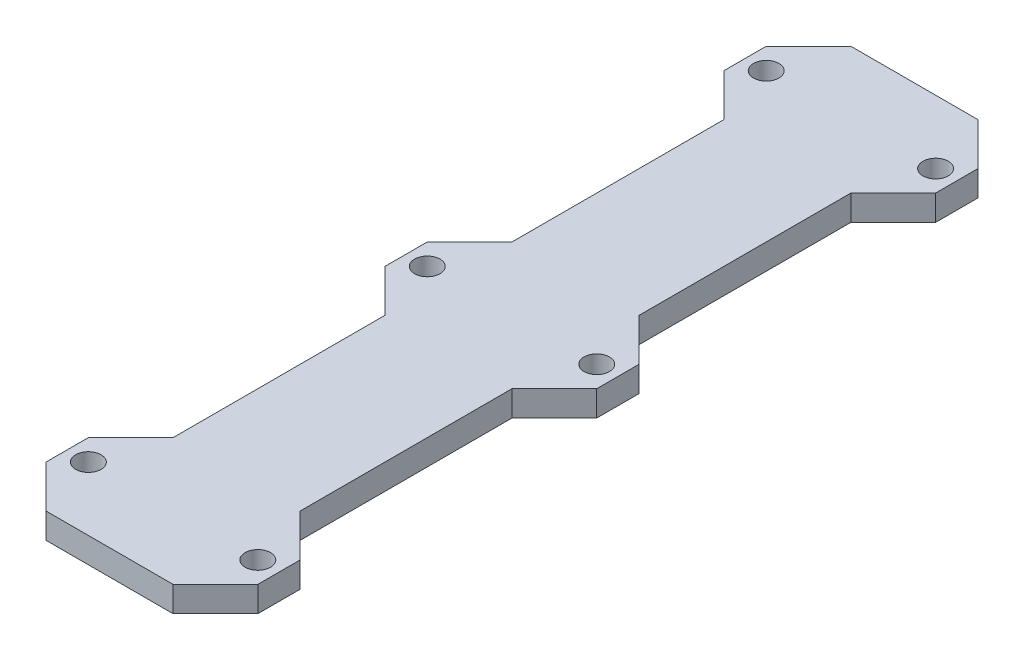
ISO-10303-21;
HEADER;
FILE_DESCRIPTION(('STEP AP214'),'2;1');
FILE_NAME('part.step','',(''),(''),'','','');
FILE_SCHEMA(('AUTOMOTIVE_DESIGN { 1 0 10303 214 1 1 1 1 }'));
ENDSEC;
DATA;
#1=APPLICATION_CONTEXT('core data for automotive mechanical design processes');
#2=APPLICATION_PROTOCOL_DEFINITION('international standard','automotive_design',2000,#1);
#3=PRODUCT_CONTEXT('',#1,'mechanical');
#4=PRODUCT('Part','Part','',(#3));
#5=PRODUCT_RELATED_PRODUCT_CATEGORY('part','',(#4));
#6=PRODUCT_DEFINITION_FORMATION('','',#4);
#7=PRODUCT_DEFINITION_CONTEXT('part definition',#1,'design');
#8=PRODUCT_DEFINITION('design','',#6,#7);
#9=PRODUCT_DEFINITION_SHAPE('','',#8);
#10=(LENGTH_UNIT() NAMED_UNIT(*) SI_UNIT(.MILLI.,.METRE.));
#11=(NAMED_UNIT(*) PLANE_ANGLE_UNIT() SI_UNIT($,.RADIAN.));
#12=(NAMED_UNIT(*) SI_UNIT($,.STERADIAN.) SOLID_ANGLE_UNIT());
#13=UNCERTAINTY_MEASURE_WITH_UNIT(LENGTH_MEASURE(1.E-05),#10,'distance_accuracy_value','');
#14=(GEOMETRIC_REPRESENTATION_CONTEXT(3) GLOBAL_UNCERTAINTY_ASSIGNED_CONTEXT((#13)) GLOBAL_UNIT_ASSIGNED_CONTEXT((#10,
#11,#12)) REPRESENTATION_CONTEXT('',''));
#15=CARTESIAN_POINT('',(0.,0.,0.));
#16=DIRECTION('',(0.,0.,1.));
#17=DIRECTION('',(1.,0.,0.));
#18=AXIS2_PLACEMENT_3D('',#15,#16,#17);
#19=CARTESIAN_POINT('',(0.,3.,0.));
#20=DIRECTION('',(0.,1.,0.));
#21=DIRECTION('',(0.,0.,1.));
#22=AXIS2_PLACEMENT_3D('',#19,#20,#21);
#23=PLANE('',#22);
#24=CARTESIAN_POINT('',(-10.,3.,-40.));
#25=DIRECTION('',(0.,1.,0.));
#26=DIRECTION('',(0.,0.,-1.));
#27=AXIS2_PLACEMENT_3D('',#24,#25,#26);
#28=CIRCLE('',#27,1.5);
#29=CARTESIAN_POINT('',(-10.,3.,-41.5));
#30=VERTEX_POINT('',#29);
#31=EDGE_CURVE('E458',#30,#30,#28,.T.);
#32=ORIENTED_EDGE('',*,*,#31,.F.);
#33=EDGE_LOOP('',(#32));
#34=FACE_BOUND('',#33,.T.);
#35=CARTESIAN_POINT('',(9.99999999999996,3.,40.));
#36=DIRECTION('',(0.,1.,0.));
#37=DIRECTION('',(0.,0.,1.));
#38=AXIS2_PLACEMENT_3D('',#35,#36,#37);
#39=CIRCLE('',#38,1.5);
#40=CARTESIAN_POINT('',(9.99999999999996,3.,41.5));
#41=VERTEX_POINT('',#40);
#42=EDGE_CURVE('E470',#41,#41,#39,.T.);
#43=ORIENTED_EDGE('',*,*,#42,.F.);
#44=EDGE_LOOP('',(#43));
#45=FACE_BOUND('',#44,.T.);
#46=CARTESIAN_POINT('',(10.,3.,-40.));
#47=DIRECTION('',(0.,1.,0.));
#48=DIRECTION('',(0.,0.,1.));
#49=AXIS2_PLACEMENT_3D('',#46,#47,#48);
#50=CIRCLE('',#49,1.5);
#51=CARTESIAN_POINT('',(10.,3.,-38.5));
#52=VERTEX_POINT('',#51);
#53=EDGE_CURVE('E233',#52,#52,#50,.T.);
#54=ORIENTED_EDGE('',*,*,#53,.F.);
#55=EDGE_LOOP('',(#54));
#56=FACE_BOUND('',#55,.T.);
#57=DIRECTION('',(0.707106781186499,0.,0.707106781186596));
#58=VECTOR('',#57,1.);
#59=CARTESIAN_POINT('',(-12.5,3.,2.50000000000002));
#60=LINE('',#59,#58);
#61=CARTESIAN_POINT('',(-12.5,3.,2.50000000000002));
#62=VERTEX_POINT('',#61);
#63=CARTESIAN_POINT('',(-7.5,3.,7.50000000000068));
#64=VERTEX_POINT('',#63);
#65=EDGE_CURVE('E276',#62,#64,#60,.T.);
#66=ORIENTED_EDGE('',*,*,#65,.T.);
#67=DIRECTION('',(0.,0.,1.));
#68=VECTOR('',#67,1.);
#69=CARTESIAN_POINT('',(-7.5,3.,7.50000000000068));
#70=LINE('',#69,#68);
#71=CARTESIAN_POINT('',(-7.49999999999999,3.,32.5000000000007));
#72=VERTEX_POINT('',#71);
#73=EDGE_CURVE('E144',#64,#72,#70,.T.);
#74=ORIENTED_EDGE('',*,*,#73,.T.);
#75=DIRECTION('',(-0.707106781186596,0.,0.707106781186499));
#76=VECTOR('',#75,1.);
#77=CARTESIAN_POINT('',(-12.5,3.,37.5));
#78=LINE('',#77,#76);
#79=CARTESIAN_POINT('',(-12.5,3.,37.5));
#80=VERTEX_POINT('',#79);
#81=EDGE_CURVE('E339',#72,#80,#78,.T.);
#82=ORIENTED_EDGE('',*,*,#81,.T.);
#83=DIRECTION('',(0.,0.,1.));
#84=VECTOR('',#83,1.);
#85=CARTESIAN_POINT('',(-12.5,3.,42.5));
#86=LINE('',#85,#84);
#87=CARTESIAN_POINT('',(-12.5,3.,42.5));
#88=VERTEX_POINT('',#87);
#89=EDGE_CURVE('E358',#80,#88,#86,.T.);
#90=ORIENTED_EDGE('',*,*,#89,.T.);
#91=DIRECTION('',(0.707106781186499,0.,0.707106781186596));
#92=VECTOR('',#91,1.);
#93=CARTESIAN_POINT('',(-12.5,3.,42.5));
#94=LINE('',#93,#92);
#95=CARTESIAN_POINT('',(-7.5,3.,47.5000000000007));
#96=VERTEX_POINT('',#95);
#97=EDGE_CURVE('E355',#88,#96,#94,.T.);
#98=ORIENTED_EDGE('',*,*,#97,.T.);
#99=DIRECTION('',(1.,0.,0.));
#100=VECTOR('',#99,1.);
#101=CARTESIAN_POINT('',(-7.5,3.,47.5000000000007));
#102=LINE('',#101,#100);
#103=CARTESIAN_POINT('',(7.5,3.,47.5000000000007));
#104=VERTEX_POINT('',#103);
#105=EDGE_CURVE('E357',#96,#104,#102,.T.);
#106=ORIENTED_EDGE('',*,*,#105,.T.);
#107=DIRECTION('',(0.707106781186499,0.,-0.707106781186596));
#108=VECTOR('',#107,1.);
#109=CARTESIAN_POINT('',(12.5,3.,42.5));
#110=LINE('',#109,#108);
#111=CARTESIAN_POINT('',(12.5,3.,42.5));
#112=VERTEX_POINT('',#111);
#113=EDGE_CURVE('E360',#104,#112,#110,.T.);
#114=ORIENTED_EDGE('',*,*,#113,.T.);
#115=DIRECTION('',(0.,0.,-1.));
#116=VECTOR('',#115,1.);
#117=CARTESIAN_POINT('',(12.5,3.,42.5));
#118=LINE('',#117,#116);
#119=CARTESIAN_POINT('',(12.5,3.,37.5));
#120=VERTEX_POINT('',#119);
#121=EDGE_CURVE('E366',#112,#120,#118,.T.);
#122=ORIENTED_EDGE('',*,*,#121,.T.);
#123=DIRECTION('',(-0.707106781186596,0.,-0.707106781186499));
#124=VECTOR('',#123,1.);
#125=CARTESIAN_POINT('',(12.5,3.,37.5));
#126=LINE('',#125,#124);
#127=CARTESIAN_POINT('',(7.49999999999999,3.,32.5000000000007));
#128=VERTEX_POINT('',#127);
#129=EDGE_CURVE('E368',#120,#128,#126,.T.);
#130=ORIENTED_EDGE('',*,*,#129,.T.);
#131=DIRECTION('',(0.,0.,-1.));
#132=VECTOR('',#131,1.);
#133=CARTESIAN_POINT('',(7.49999999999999,3.,32.5000000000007));
#134=LINE('',#133,#132);
#135=CARTESIAN_POINT('',(7.5,3.,7.50000000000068));
#136=VERTEX_POINT('',#135);
#137=EDGE_CURVE('E370',#128,#136,#134,.T.);
#138=ORIENTED_EDGE('',*,*,#137,.T.);
#139=DIRECTION('',(0.707106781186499,0.,-0.707106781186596));
#140=VECTOR('',#139,1.);
#141=CARTESIAN_POINT('',(12.5,3.,2.50000000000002));
#142=LINE('',#141,#140);
#143=CARTESIAN_POINT('',(12.5,3.,2.50000000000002));
#144=VERTEX_POINT('',#143);
#145=EDGE_CURVE('E372',#136,#144,#142,.T.);
#146=ORIENTED_EDGE('',*,*,#145,.T.);
#147=DIRECTION('',(0.,0.,-1.));
#148=VECTOR('',#147,1.);
#149=CARTESIAN_POINT('',(12.5,3.,2.50000000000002));
#150=LINE('',#149,#148);
#151=CARTESIAN_POINT('',(12.5,3.,-2.50000000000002));
#152=VERTEX_POINT('',#151);
#153=EDGE_CURVE('E374',#144,#152,#150,.T.);
#154=ORIENTED_EDGE('',*,*,#153,.T.);
#155=DIRECTION('',(-0.707106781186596,0.,-0.707106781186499));
#156=VECTOR('',#155,1.);
#157=CARTESIAN_POINT('',(12.5,3.,-2.50000000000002));
#158=LINE('',#157,#156);
#159=CARTESIAN_POINT('',(7.5,3.,-7.49999999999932));
#160=VERTEX_POINT('',#159);
#161=EDGE_CURVE('E376',#152,#160,#158,.T.);
#162=ORIENTED_EDGE('',*,*,#161,.T.);
#163=DIRECTION('',(0.,0.,-1.));
#164=VECTOR('',#163,1.);
#165=CARTESIAN_POINT('',(7.5,3.,-7.49999999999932));
#166=LINE('',#165,#164);
#167=CARTESIAN_POINT('',(7.50000000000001,3.,-32.4999999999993));
#168=VERTEX_POINT('',#167);
#169=EDGE_CURVE('E378',#160,#168,#166,.T.);
#170=ORIENTED_EDGE('',*,*,#169,.T.);
#171=DIRECTION('',(0.707106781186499,0.,-0.707106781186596));
#172=VECTOR('',#171,1.);
#173=CARTESIAN_POINT('',(12.5,3.,-37.5));
#174=LINE('',#173,#172);
#175=CARTESIAN_POINT('',(12.5,3.,-37.5));
#176=VERTEX_POINT('',#175);
#177=EDGE_CURVE('E380',#168,#176,#174,.T.);
#178=ORIENTED_EDGE('',*,*,#177,.T.);
#179=DIRECTION('',(0.,0.,-1.));
#180=VECTOR('',#179,1.);
#181=CARTESIAN_POINT('',(12.5,3.,-37.5));
#182=LINE('',#181,#180);
#183=CARTESIAN_POINT('',(12.5,3.,-42.5));
#184=VERTEX_POINT('',#183);
#185=EDGE_CURVE('E382',#176,#184,#182,.T.);
#186=ORIENTED_EDGE('',*,*,#185,.T.);
#187=DIRECTION('',(-0.707106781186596,0.,-0.7071067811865));
#188=VECTOR('',#187,1.);
#189=CARTESIAN_POINT('',(12.5,3.,-42.5));
#190=LINE('',#189,#188);
#191=CARTESIAN_POINT('',(7.5,3.,-47.4999999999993));
#192=VERTEX_POINT('',#191);
#193=EDGE_CURVE('E384',#184,#192,#190,.T.);
#194=ORIENTED_EDGE('',*,*,#193,.T.);
#195=DIRECTION('',(-1.,0.,0.));
#196=VECTOR('',#195,1.);
#197=CARTESIAN_POINT('',(7.5,3.,-47.4999999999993));
#198=LINE('',#197,#196);
#199=CARTESIAN_POINT('',(-7.5,3.,-47.4999999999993));
#200=VERTEX_POINT('',#199);
#201=EDGE_CURVE('E386',#192,#200,#198,.T.);
#202=ORIENTED_EDGE('',*,*,#201,.T.);
#203=DIRECTION('',(-0.707106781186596,0.,0.707106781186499));
#204=VECTOR('',#203,1.);
#205=CARTESIAN_POINT('',(-12.5,3.,-42.5));
#206=LINE('',#205,#204);
#207=CARTESIAN_POINT('',(-12.5,3.,-42.5));
#208=VERTEX_POINT('',#207);
#209=EDGE_CURVE('E388',#200,#208,#206,.T.);
#210=ORIENTED_EDGE('',*,*,#209,.T.);
#211=DIRECTION('',(0.,0.,1.));
#212=VECTOR('',#211,1.);
#213=CARTESIAN_POINT('',(-12.5,3.,-37.5));
#214=LINE('',#213,#212);
#215=CARTESIAN_POINT('',(-12.5,3.,-37.5));
#216=VERTEX_POINT('',#215);
#217=EDGE_CURVE('E390',#208,#216,#214,.T.);
#218=ORIENTED_EDGE('',*,*,#217,.T.);
#219=DIRECTION('',(0.707106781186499,0.,0.707106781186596));
#220=VECTOR('',#219,1.);
#221=CARTESIAN_POINT('',(-12.5,3.,-37.5));
#222=LINE('',#221,#220);
#223=CARTESIAN_POINT('',(-7.50000000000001,3.,-32.4999999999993));
#224=VERTEX_POINT('',#223);
#225=EDGE_CURVE('E211',#216,#224,#222,.T.);
#226=ORIENTED_EDGE('',*,*,#225,.T.);
#227=DIRECTION('',(0.,0.,1.));
#228=VECTOR('',#227,1.);
#229=CARTESIAN_POINT('',(-7.50000000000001,3.,-32.4999999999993));
#230=LINE('',#229,#228);
#231=CARTESIAN_POINT('',(-7.5,3.,-7.49999999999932));
#232=VERTEX_POINT('',#231);
#233=EDGE_CURVE('E205',#224,#232,#230,.T.);
#234=ORIENTED_EDGE('',*,*,#233,.T.);
#235=DIRECTION('',(-0.707106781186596,0.,0.707106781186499));
#236=VECTOR('',#235,1.);
#237=CARTESIAN_POINT('',(-12.5,3.,-2.50000000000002));
#238=LINE('',#237,#236);
#239=CARTESIAN_POINT('',(-12.5,3.,-2.50000000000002));
#240=VERTEX_POINT('',#239);
#241=EDGE_CURVE('E209',#232,#240,#238,.T.);
#242=ORIENTED_EDGE('',*,*,#241,.T.);
#243=DIRECTION('',(0.,0.,1.));
#244=VECTOR('',#243,1.);
#245=CARTESIAN_POINT('',(-12.5,3.,2.50000000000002));
#246=LINE('',#245,#244);
#247=EDGE_CURVE('E53',#240,#62,#246,.T.);
#248=ORIENTED_EDGE('',*,*,#247,.T.);
#249=EDGE_LOOP('',(#66,#74,#82,#90,#98,#106,#114,#122,#130,#138,#146,#154,#162,#170,#178,#186,
#194,#202,#210,#218,#226,#234,#242,#248));
#250=FACE_BOUND('',#249,.T.);
#251=CARTESIAN_POINT('',(9.99999999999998,3.,0.));
#252=DIRECTION('',(0.,1.,0.));
#253=DIRECTION('',(0.,0.,1.));
#254=AXIS2_PLACEMENT_3D('',#251,#252,#253);
#255=CIRCLE('',#254,1.5);
#256=CARTESIAN_POINT('',(9.99999999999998,3.,1.5));
#257=VERTEX_POINT('',#256);
#258=EDGE_CURVE('E476',#257,#257,#255,.T.);
#259=ORIENTED_EDGE('',*,*,#258,.F.);
#260=EDGE_LOOP('',(#259));
#261=FACE_BOUND('',#260,.T.);
#262=CARTESIAN_POINT('',(-9.99999999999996,3.,40.));
#263=DIRECTION('',(0.,1.,0.));
#264=DIRECTION('',(0.,0.,-1.));
#265=AXIS2_PLACEMENT_3D('',#262,#263,#264);
#266=CIRCLE('',#265,1.5);
#267=CARTESIAN_POINT('',(-9.99999999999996,3.,38.5));
#268=VERTEX_POINT('',#267);
#269=EDGE_CURVE('E464',#268,#268,#266,.T.);
#270=ORIENTED_EDGE('',*,*,#269,.F.);
#271=EDGE_LOOP('',(#270));
#272=FACE_BOUND('',#271,.T.);
#273=CARTESIAN_POINT('',(-9.99999999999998,3.,0.));
#274=DIRECTION('',(0.,1.,0.));
#275=DIRECTION('',(0.,0.,-1.));
#276=AXIS2_PLACEMENT_3D('',#273,#274,#275);
#277=CIRCLE('',#276,1.5);
#278=CARTESIAN_POINT('',(-9.99999999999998,3.,-1.5));
#279=VERTEX_POINT('',#278);
#280=EDGE_CURVE('E449',#279,#279,#277,.T.);
#281=ORIENTED_EDGE('',*,*,#280,.F.);
#282=EDGE_LOOP('',(#281));
#283=FACE_BOUND('',#282,.T.);
#284=ADVANCED_FACE('F36',(#34,#45,#56,#250,#261,#272,#283),#23,.T.);
#285=CARTESIAN_POINT('',(0.,0.,0.));
#286=DIRECTION('',(0.,1.,0.));
#287=DIRECTION('',(0.,0.,1.));
#288=AXIS2_PLACEMENT_3D('',#285,#286,#287);
#289=PLANE('',#288);
#290=DIRECTION('',(0.707106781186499,0.,0.707106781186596));
#291=VECTOR('',#290,1.);
#292=CARTESIAN_POINT('',(-12.5,0.,2.50000000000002));
#293=LINE('',#292,#291);
#294=CARTESIAN_POINT('',(-12.5,0.,2.50000000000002));
#295=VERTEX_POINT('',#294);
#296=CARTESIAN_POINT('',(-7.5,0.,7.50000000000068));
#297=VERTEX_POINT('',#296);
#298=EDGE_CURVE('E229',#295,#297,#293,.T.);
#299=ORIENTED_EDGE('',*,*,#298,.F.);
#300=DIRECTION('',(0.,0.,1.));
#301=VECTOR('',#300,1.);
#302=CARTESIAN_POINT('',(-12.5,0.,2.50000000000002));
#303=LINE('',#302,#301);
#304=CARTESIAN_POINT('',(-12.5,0.,-2.50000000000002));
#305=VERTEX_POINT('',#304);
#306=EDGE_CURVE('E136',#305,#295,#303,.T.);
#307=ORIENTED_EDGE('',*,*,#306,.F.);
#308=DIRECTION('',(-0.707106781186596,0.,0.707106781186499));
#309=VECTOR('',#308,1.);
#310=CARTESIAN_POINT('',(-12.5,0.,-2.50000000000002));
#311=LINE('',#310,#309);
#312=CARTESIAN_POINT('',(-7.5,0.,-7.49999999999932));
#313=VERTEX_POINT('',#312);
#314=EDGE_CURVE('E130',#313,#305,#311,.T.);
#315=ORIENTED_EDGE('',*,*,#314,.F.);
#316=DIRECTION('',(0.,0.,1.));
#317=VECTOR('',#316,1.);
#318=CARTESIAN_POINT('',(-7.50000000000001,0.,-32.4999999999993));
#319=LINE('',#318,#317);
#320=CARTESIAN_POINT('',(-7.50000000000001,0.,-32.4999999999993));
#321=VERTEX_POINT('',#320);
#322=EDGE_CURVE('E219',#321,#313,#319,.T.);
#323=ORIENTED_EDGE('',*,*,#322,.F.);
#324=DIRECTION('',(0.707106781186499,0.,0.707106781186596));
#325=VECTOR('',#324,1.);
#326=CARTESIAN_POINT('',(-12.5,0.,-37.5));
#327=LINE('',#326,#325);
#328=CARTESIAN_POINT('',(-12.5,0.,-37.5));
#329=VERTEX_POINT('',#328);
#330=EDGE_CURVE('E271',#329,#321,#327,.T.);
#331=ORIENTED_EDGE('',*,*,#330,.F.);
#332=DIRECTION('',(0.,0.,1.));
#333=VECTOR('',#332,1.);
#334=CARTESIAN_POINT('',(-12.5,0.,-37.5));
#335=LINE('',#334,#333);
#336=CARTESIAN_POINT('',(-12.5,0.,-42.5));
#337=VERTEX_POINT('',#336);
#338=EDGE_CURVE('E269',#337,#329,#335,.T.);
#339=ORIENTED_EDGE('',*,*,#338,.F.);
#340=DIRECTION('',(-0.707106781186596,0.,0.707106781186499));
#341=VECTOR('',#340,1.);
#342=CARTESIAN_POINT('',(-12.5,0.,-42.5));
#343=LINE('',#342,#341);
#344=CARTESIAN_POINT('',(-7.5,0.,-47.4999999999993));
#345=VERTEX_POINT('',#344);
#346=EDGE_CURVE('E267',#345,#337,#343,.T.);
#347=ORIENTED_EDGE('',*,*,#346,.F.);
#348=DIRECTION('',(-1.,0.,0.));
#349=VECTOR('',#348,1.);
#350=CARTESIAN_POINT('',(7.5,0.,-47.4999999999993));
#351=LINE('',#350,#349);
#352=CARTESIAN_POINT('',(7.5,0.,-47.4999999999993));
#353=VERTEX_POINT('',#352);
#354=EDGE_CURVE('E265',#353,#345,#351,.T.);
#355=ORIENTED_EDGE('',*,*,#354,.F.);
#356=DIRECTION('',(-0.707106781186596,0.,-0.7071067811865));
#357=VECTOR('',#356,1.);
#358=CARTESIAN_POINT('',(12.5,0.,-42.5));
#359=LINE('',#358,#357);
#360=CARTESIAN_POINT('',(12.5,0.,-42.5));
#361=VERTEX_POINT('',#360);
#362=EDGE_CURVE('E263',#361,#353,#359,.T.);
#363=ORIENTED_EDGE('',*,*,#362,.F.);
#364=DIRECTION('',(0.,0.,-1.));
#365=VECTOR('',#364,1.);
#366=CARTESIAN_POINT('',(12.5,0.,-37.5));
#367=LINE('',#366,#365);
#368=CARTESIAN_POINT('',(12.5,0.,-37.5));
#369=VERTEX_POINT('',#368);
#370=EDGE_CURVE('E261',#369,#361,#367,.T.);
#371=ORIENTED_EDGE('',*,*,#370,.F.);
#372=DIRECTION('',(0.707106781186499,0.,-0.707106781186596));
#373=VECTOR('',#372,1.);
#374=CARTESIAN_POINT('',(12.5,0.,-37.5));
#375=LINE('',#374,#373);
#376=CARTESIAN_POINT('',(7.50000000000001,0.,-32.4999999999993));
#377=VERTEX_POINT('',#376);
#378=EDGE_CURVE('E259',#377,#369,#375,.T.);
#379=ORIENTED_EDGE('',*,*,#378,.F.);
#380=DIRECTION('',(0.,0.,-1.));
#381=VECTOR('',#380,1.);
#382=CARTESIAN_POINT('',(7.5,0.,-7.49999999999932));
#383=LINE('',#382,#381);
#384=CARTESIAN_POINT('',(7.5,0.,-7.49999999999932));
#385=VERTEX_POINT('',#384);
#386=EDGE_CURVE('E257',#385,#377,#383,.T.);
#387=ORIENTED_EDGE('',*,*,#386,.F.);
#388=DIRECTION('',(-0.707106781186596,0.,-0.707106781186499));
#389=VECTOR('',#388,1.);
#390=CARTESIAN_POINT('',(12.5,0.,-2.50000000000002));
#391=LINE('',#390,#389);
#392=CARTESIAN_POINT('',(12.5,0.,-2.50000000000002));
#393=VERTEX_POINT('',#392);
#394=EDGE_CURVE('E255',#393,#385,#391,.T.);
#395=ORIENTED_EDGE('',*,*,#394,.F.);
#396=DIRECTION('',(0.,0.,-1.));
#397=VECTOR('',#396,1.);
#398=CARTESIAN_POINT('',(12.5,0.,2.50000000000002));
#399=LINE('',#398,#397);
#400=CARTESIAN_POINT('',(12.5,0.,2.50000000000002));
#401=VERTEX_POINT('',#400);
#402=EDGE_CURVE('E253',#401,#393,#399,.T.);
#403=ORIENTED_EDGE('',*,*,#402,.F.);
#404=DIRECTION('',(0.707106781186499,0.,-0.707106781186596));
#405=VECTOR('',#404,1.);
#406=CARTESIAN_POINT('',(12.5,0.,2.50000000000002));
#407=LINE('',#406,#405);
#408=CARTESIAN_POINT('',(7.5,0.,7.50000000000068));
#409=VERTEX_POINT('',#408);
#410=EDGE_CURVE('E251',#409,#401,#407,.T.);
#411=ORIENTED_EDGE('',*,*,#410,.F.);
#412=DIRECTION('',(0.,0.,-1.));
#413=VECTOR('',#412,1.);
#414=CARTESIAN_POINT('',(7.49999999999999,0.,32.5000000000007));
#415=LINE('',#414,#413);
#416=CARTESIAN_POINT('',(7.49999999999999,0.,32.5000000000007));
#417=VERTEX_POINT('',#416);
#418=EDGE_CURVE('E249',#417,#409,#415,.T.);
#419=ORIENTED_EDGE('',*,*,#418,.F.);
#420=DIRECTION('',(-0.707106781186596,0.,-0.707106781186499));
#421=VECTOR('',#420,1.);
#422=CARTESIAN_POINT('',(12.5,0.,37.5));
#423=LINE('',#422,#421);
#424=CARTESIAN_POINT('',(12.5,0.,37.5));
#425=VERTEX_POINT('',#424);
#426=EDGE_CURVE('E247',#425,#417,#423,.T.);
#427=ORIENTED_EDGE('',*,*,#426,.F.);
#428=DIRECTION('',(0.,0.,-1.));
#429=VECTOR('',#428,1.);
#430=CARTESIAN_POINT('',(12.5,0.,42.5));
#431=LINE('',#430,#429);
#432=CARTESIAN_POINT('',(12.5,0.,42.5));
#433=VERTEX_POINT('',#432);
#434=EDGE_CURVE('E245',#433,#425,#431,.T.);
#435=ORIENTED_EDGE('',*,*,#434,.F.);
#436=DIRECTION('',(0.707106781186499,0.,-0.707106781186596));
#437=VECTOR('',#436,1.);
#438=CARTESIAN_POINT('',(12.5,0.,42.5));
#439=LINE('',#438,#437);
#440=CARTESIAN_POINT('',(7.5,0.,47.5000000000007));
#441=VERTEX_POINT('',#440);
#442=EDGE_CURVE('E243',#441,#433,#439,.T.);
#443=ORIENTED_EDGE('',*,*,#442,.F.);
#444=DIRECTION('',(1.,0.,0.));
#445=VECTOR('',#444,1.);
#446=CARTESIAN_POINT('',(-7.5,0.,47.5000000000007));
#447=LINE('',#446,#445);
#448=CARTESIAN_POINT('',(-7.5,0.,47.5000000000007));
#449=VERTEX_POINT('',#448);
#450=EDGE_CURVE('E241',#449,#441,#447,.T.);
#451=ORIENTED_EDGE('',*,*,#450,.F.);
#452=DIRECTION('',(0.707106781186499,0.,0.707106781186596));
#453=VECTOR('',#452,1.);
#454=CARTESIAN_POINT('',(-12.5,0.,42.5));
#455=LINE('',#454,#453);
#456=CARTESIAN_POINT('',(-12.5,0.,42.5));
#457=VERTEX_POINT('',#456);
#458=EDGE_CURVE('E239',#457,#449,#455,.T.);
#459=ORIENTED_EDGE('',*,*,#458,.F.);
#460=DIRECTION('',(0.,0.,1.));
#461=VECTOR('',#460,1.);
#462=CARTESIAN_POINT('',(-12.5,0.,42.5));
#463=LINE('',#462,#461);
#464=CARTESIAN_POINT('',(-12.5,0.,37.5));
#465=VERTEX_POINT('',#464);
#466=EDGE_CURVE('E237',#465,#457,#463,.T.);
#467=ORIENTED_EDGE('',*,*,#466,.F.);
#468=DIRECTION('',(-0.707106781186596,0.,0.707106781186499));
#469=VECTOR('',#468,1.);
#470=CARTESIAN_POINT('',(-12.5,0.,37.5));
#471=LINE('',#470,#469);
#472=CARTESIAN_POINT('',(-7.49999999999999,0.,32.5000000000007));
#473=VERTEX_POINT('',#472);
#474=EDGE_CURVE('E235',#473,#465,#471,.T.);
#475=ORIENTED_EDGE('',*,*,#474,.F.);
#476=DIRECTION('',(0.,0.,1.));
#477=VECTOR('',#476,1.);
#478=CARTESIAN_POINT('',(-7.5,0.,7.50000000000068));
#479=LINE('',#478,#477);
#480=EDGE_CURVE('E232',#297,#473,#479,.T.);
#481=ORIENTED_EDGE('',*,*,#480,.F.);
#482=EDGE_LOOP('',(#299,#307,#315,#323,#331,#339,#347,#355,#363,#371,#379,#387,#395,#403,#411,
#419,#427,#435,#443,#451,#459,#467,#475,#481));
#483=FACE_BOUND('',#482,.T.);
#484=CARTESIAN_POINT('',(10.,0.,-40.));
#485=DIRECTION('',(0.,1.,0.));
#486=DIRECTION('',(0.,0.,1.));
#487=AXIS2_PLACEMENT_3D('',#484,#485,#486);
#488=CIRCLE('',#487,1.5);
#489=CARTESIAN_POINT('',(10.,0.,-38.5));
#490=VERTEX_POINT('',#489);
#491=EDGE_CURVE('E479',#490,#490,#488,.T.);
#492=ORIENTED_EDGE('',*,*,#491,.T.);
#493=EDGE_LOOP('',(#492));
#494=FACE_BOUND('',#493,.T.);
#495=CARTESIAN_POINT('',(9.99999999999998,0.,0.));
#496=DIRECTION('',(0.,1.,0.));
#497=DIRECTION('',(0.,0.,1.));
#498=AXIS2_PLACEMENT_3D('',#495,#496,#497);
#499=CIRCLE('',#498,1.5);
#500=CARTESIAN_POINT('',(9.99999999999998,0.,1.5));
#501=VERTEX_POINT('',#500);
#502=EDGE_CURVE('E473',#501,#501,#499,.T.);
#503=ORIENTED_EDGE('',*,*,#502,.T.);
#504=EDGE_LOOP('',(#503));
#505=FACE_BOUND('',#504,.T.);
#506=CARTESIAN_POINT('',(9.99999999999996,0.,40.));
#507=DIRECTION('',(0.,1.,0.));
#508=DIRECTION('',(0.,0.,1.));
#509=AXIS2_PLACEMENT_3D('',#506,#507,#508);
#510=CIRCLE('',#509,1.5);
#511=CARTESIAN_POINT('',(9.99999999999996,0.,41.5));
#512=VERTEX_POINT('',#511);
#513=EDGE_CURVE('E467',#512,#512,#510,.T.);
#514=ORIENTED_EDGE('',*,*,#513,.T.);
#515=EDGE_LOOP('',(#514));
#516=FACE_BOUND('',#515,.T.);
#517=CARTESIAN_POINT('',(-9.99999999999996,0.,40.));
#518=DIRECTION('',(0.,1.,0.));
#519=DIRECTION('',(0.,0.,-1.));
#520=AXIS2_PLACEMENT_3D('',#517,#518,#519);
#521=CIRCLE('',#520,1.5);
#522=CARTESIAN_POINT('',(-9.99999999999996,0.,38.5));
#523=VERTEX_POINT('',#522);
#524=EDGE_CURVE('E461',#523,#523,#521,.T.);
#525=ORIENTED_EDGE('',*,*,#524,.T.);
#526=EDGE_LOOP('',(#525));
#527=FACE_BOUND('',#526,.T.);
#528=CARTESIAN_POINT('',(-10.,0.,-40.));
#529=DIRECTION('',(0.,1.,0.));
#530=DIRECTION('',(0.,0.,-1.));
#531=AXIS2_PLACEMENT_3D('',#528,#529,#530);
#532=CIRCLE('',#531,1.5);
#533=CARTESIAN_POINT('',(-10.,0.,-41.5));
#534=VERTEX_POINT('',#533);
#535=EDGE_CURVE('E455',#534,#534,#532,.T.);
#536=ORIENTED_EDGE('',*,*,#535,.T.);
#537=EDGE_LOOP('',(#536));
#538=FACE_BOUND('',#537,.T.);
#539=CARTESIAN_POINT('',(-9.99999999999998,0.,0.));
#540=DIRECTION('',(0.,1.,0.));
#541=DIRECTION('',(0.,0.,-1.));
#542=AXIS2_PLACEMENT_3D('',#539,#540,#541);
#543=CIRCLE('',#542,1.5);
#544=CARTESIAN_POINT('',(-9.99999999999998,0.,-1.5));
#545=VERTEX_POINT('',#544);
#546=EDGE_CURVE('E452',#545,#545,#543,.T.);
#547=ORIENTED_EDGE('',*,*,#546,.T.);
#548=EDGE_LOOP('',(#547));
#549=FACE_BOUND('',#548,.T.);
#550=ADVANCED_FACE('F343',(#483,#494,#505,#516,#527,#538,#549),#289,.F.);
#551=CARTESIAN_POINT('',(-12.5,3.,2.50000000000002));
#552=DIRECTION('',(0.707106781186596,0.,-0.707106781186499));
#553=DIRECTION('',(-0.707106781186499,0.,-0.707106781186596));
#554=AXIS2_PLACEMENT_3D('',#551,#552,#553);
#555=PLANE('',#554);
#556=ORIENTED_EDGE('',*,*,#298,.T.);
#557=DIRECTION('',(0.,-1.,0.));
#558=VECTOR('',#557,1.);
#559=CARTESIAN_POINT('',(-7.5,3.,7.50000000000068));
#560=LINE('',#559,#558);
#561=EDGE_CURVE('E11',#64,#297,#560,.T.);
#562=ORIENTED_EDGE('',*,*,#561,.F.);
#563=ORIENTED_EDGE('',*,*,#65,.F.);
#564=DIRECTION('',(0.,-1.,0.));
#565=VECTOR('',#564,1.);
#566=CARTESIAN_POINT('',(-12.5,3.,2.50000000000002));
#567=LINE('',#566,#565);
#568=EDGE_CURVE('E225',#62,#295,#567,.T.);
#569=ORIENTED_EDGE('',*,*,#568,.T.);
#570=EDGE_LOOP('',(#556,#562,#563,#569));
#571=FACE_BOUND('',#570,.T.);
#572=ADVANCED_FACE('F38',(#571),#555,.F.);
#573=CARTESIAN_POINT('',(-7.5,3.,7.50000000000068));
#574=DIRECTION('',(1.,0.,0.));
#575=DIRECTION('',(0.,0.,-1.));
#576=AXIS2_PLACEMENT_3D('',#573,#574,#575);
#577=PLANE('',#576);
#578=ORIENTED_EDGE('',*,*,#480,.T.);
#579=DIRECTION('',(0.,-1.,0.));
#580=VECTOR('',#579,1.);
#581=CARTESIAN_POINT('',(-7.49999999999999,3.,32.5000000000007));
#582=LINE('',#581,#580);
#583=EDGE_CURVE('E45',#72,#473,#582,.T.);
#584=ORIENTED_EDGE('',*,*,#583,.F.);
#585=ORIENTED_EDGE('',*,*,#73,.F.);
#586=ORIENTED_EDGE('',*,*,#561,.T.);
#587=EDGE_LOOP('',(#578,#584,#585,#586));
#588=FACE_BOUND('',#587,.T.);
#589=ADVANCED_FACE('F749',(#588),#577,.F.);
#590=CARTESIAN_POINT('',(-12.5,3.,37.5));
#591=DIRECTION('',(0.707106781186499,0.,0.707106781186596));
#592=DIRECTION('',(0.707106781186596,0.,-0.707106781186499));
#593=AXIS2_PLACEMENT_3D('',#590,#591,#592);
#594=PLANE('',#593);
#595=ORIENTED_EDGE('',*,*,#474,.T.);
#596=DIRECTION('',(0.,-1.,0.));
#597=VECTOR('',#596,1.);
#598=CARTESIAN_POINT('',(-12.5,3.,37.5));
#599=LINE('',#598,#597);
#600=EDGE_CURVE('E331',#80,#465,#599,.T.);
#601=ORIENTED_EDGE('',*,*,#600,.F.);
#602=ORIENTED_EDGE('',*,*,#81,.F.);
#603=ORIENTED_EDGE('',*,*,#583,.T.);
#604=EDGE_LOOP('',(#595,#601,#602,#603));
#605=FACE_BOUND('',#604,.T.);
#606=ADVANCED_FACE('F337',(#605),#594,.F.);
#607=CARTESIAN_POINT('',(-12.5,3.,42.5));
#608=DIRECTION('',(1.,0.,0.));
#609=DIRECTION('',(0.,0.,-1.));
#610=AXIS2_PLACEMENT_3D('',#607,#608,#609);
#611=PLANE('',#610);
#612=ORIENTED_EDGE('',*,*,#466,.T.);
#613=DIRECTION('',(0.,-1.,0.));
#614=VECTOR('',#613,1.);
#615=CARTESIAN_POINT('',(-12.5,3.,42.5));
#616=LINE('',#615,#614);
#617=EDGE_CURVE('E328',#88,#457,#616,.T.);
#618=ORIENTED_EDGE('',*,*,#617,.F.);
#619=ORIENTED_EDGE('',*,*,#89,.F.);
#620=ORIENTED_EDGE('',*,*,#600,.T.);
#621=EDGE_LOOP('',(#612,#618,#619,#620));
#622=FACE_BOUND('',#621,.T.);
#623=ADVANCED_FACE('F349',(#622),#611,.F.);
#624=CARTESIAN_POINT('',(-12.5,3.,42.5));
#625=DIRECTION('',(0.707106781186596,0.,-0.707106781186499));
#626=DIRECTION('',(-0.707106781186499,0.,-0.707106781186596));
#627=AXIS2_PLACEMENT_3D('',#624,#625,#626);
#628=PLANE('',#627);
#629=ORIENTED_EDGE('',*,*,#458,.T.);
#630=DIRECTION('',(0.,-1.,0.));
#631=VECTOR('',#630,1.);
#632=CARTESIAN_POINT('',(-7.5,3.,47.5000000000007));
#633=LINE('',#632,#631);
#634=EDGE_CURVE('E325',#96,#449,#633,.T.);
#635=ORIENTED_EDGE('',*,*,#634,.F.);
#636=ORIENTED_EDGE('',*,*,#97,.F.);
#637=ORIENTED_EDGE('',*,*,#617,.T.);
#638=EDGE_LOOP('',(#629,#635,#636,#637));
#639=FACE_BOUND('',#638,.T.);
#640=ADVANCED_FACE('F353',(#639),#628,.F.);
#641=CARTESIAN_POINT('',(-7.5,3.,47.5000000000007));
#642=DIRECTION('',(0.,0.,-1.));
#643=DIRECTION('',(-1.,0.,0.));
#644=AXIS2_PLACEMENT_3D('',#641,#642,#643);
#645=PLANE('',#644);
#646=ORIENTED_EDGE('',*,*,#450,.T.);
#647=DIRECTION('',(0.,-1.,0.));
#648=VECTOR('',#647,1.);
#649=CARTESIAN_POINT('',(7.5,3.,47.5000000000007));
#650=LINE('',#649,#648);
#651=EDGE_CURVE('E322',#104,#441,#650,.T.);
#652=ORIENTED_EDGE('',*,*,#651,.F.);
#653=ORIENTED_EDGE('',*,*,#105,.F.);
#654=ORIENTED_EDGE('',*,*,#634,.T.);
#655=EDGE_LOOP('',(#646,#652,#653,#654));
#656=FACE_BOUND('',#655,.T.);
#657=ADVANCED_FACE('F710',(#656),#645,.F.);
#658=CARTESIAN_POINT('',(12.5,3.,42.5));
#659=DIRECTION('',(-0.707106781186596,0.,-0.707106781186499));
#660=DIRECTION('',(-0.707106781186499,0.,0.707106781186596));
#661=AXIS2_PLACEMENT_3D('',#658,#659,#660);
#662=PLANE('',#661);
#663=ORIENTED_EDGE('',*,*,#442,.T.);
#664=DIRECTION('',(0.,-1.,0.));
#665=VECTOR('',#664,1.);
#666=CARTESIAN_POINT('',(12.5,3.,42.5));
#667=LINE('',#666,#665);
#668=EDGE_CURVE('E319',#112,#433,#667,.T.);
#669=ORIENTED_EDGE('',*,*,#668,.F.);
#670=ORIENTED_EDGE('',*,*,#113,.F.);
#671=ORIENTED_EDGE('',*,*,#651,.T.);
#672=EDGE_LOOP('',(#663,#669,#670,#671));
#673=FACE_BOUND('',#672,.T.);
#674=ADVANCED_FACE('F699',(#673),#662,.F.);
#675=CARTESIAN_POINT('',(12.5,3.,42.5));
#676=DIRECTION('',(-1.,0.,0.));
#677=DIRECTION('',(0.,0.,1.));
#678=AXIS2_PLACEMENT_3D('',#675,#676,#677);
#679=PLANE('',#678);
#680=ORIENTED_EDGE('',*,*,#434,.T.);
#681=DIRECTION('',(0.,-1.,0.));
#682=VECTOR('',#681,1.);
#683=CARTESIAN_POINT('',(12.5,3.,37.5));
#684=LINE('',#683,#682);
#685=EDGE_CURVE('E316',#120,#425,#684,.T.);
#686=ORIENTED_EDGE('',*,*,#685,.F.);
#687=ORIENTED_EDGE('',*,*,#121,.F.);
#688=ORIENTED_EDGE('',*,*,#668,.T.);
#689=EDGE_LOOP('',(#680,#686,#687,#688));
#690=FACE_BOUND('',#689,.T.);
#691=ADVANCED_FACE('F688',(#690),#679,.F.);
#692=CARTESIAN_POINT('',(12.5,3.,37.5));
#693=DIRECTION('',(-0.707106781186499,0.,0.707106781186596));
#694=DIRECTION('',(0.707106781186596,0.,0.707106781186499));
#695=AXIS2_PLACEMENT_3D('',#692,#693,#694);
#696=PLANE('',#695);
#697=ORIENTED_EDGE('',*,*,#426,.T.);
#698=DIRECTION('',(0.,-1.,0.));
#699=VECTOR('',#698,1.);
#700=CARTESIAN_POINT('',(7.49999999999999,3.,32.5000000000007));
#701=LINE('',#700,#699);
#702=EDGE_CURVE('E313',#128,#417,#701,.T.);
#703=ORIENTED_EDGE('',*,*,#702,.F.);
#704=ORIENTED_EDGE('',*,*,#129,.F.);
#705=ORIENTED_EDGE('',*,*,#685,.T.);
#706=EDGE_LOOP('',(#697,#703,#704,#705));
#707=FACE_BOUND('',#706,.T.);
#708=ADVANCED_FACE('F677',(#707),#696,.F.);
#709=CARTESIAN_POINT('',(7.49999999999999,3.,32.5000000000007));
#710=DIRECTION('',(-1.,0.,0.));
#711=DIRECTION('',(0.,0.,1.));
#712=AXIS2_PLACEMENT_3D('',#709,#710,#711);
#713=PLANE('',#712);
#714=ORIENTED_EDGE('',*,*,#418,.T.);
#715=DIRECTION('',(0.,-1.,0.));
#716=VECTOR('',#715,1.);
#717=CARTESIAN_POINT('',(7.5,3.,7.50000000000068));
#718=LINE('',#717,#716);
#719=EDGE_CURVE('E310',#136,#409,#718,.T.);
#720=ORIENTED_EDGE('',*,*,#719,.F.);
#721=ORIENTED_EDGE('',*,*,#137,.F.);
#722=ORIENTED_EDGE('',*,*,#702,.T.);
#723=EDGE_LOOP('',(#714,#720,#721,#722));
#724=FACE_BOUND('',#723,.T.);
#725=ADVANCED_FACE('F666',(#724),#713,.F.);
#726=CARTESIAN_POINT('',(12.5,3.,2.50000000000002));
#727=DIRECTION('',(-0.707106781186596,0.,-0.707106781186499));
#728=DIRECTION('',(-0.707106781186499,0.,0.707106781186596));
#729=AXIS2_PLACEMENT_3D('',#726,#727,#728);
#730=PLANE('',#729);
#731=ORIENTED_EDGE('',*,*,#410,.T.);
#732=DIRECTION('',(0.,-1.,0.));
#733=VECTOR('',#732,1.);
#734=CARTESIAN_POINT('',(12.5,3.,2.50000000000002));
#735=LINE('',#734,#733);
#736=EDGE_CURVE('E307',#144,#401,#735,.T.);
#737=ORIENTED_EDGE('',*,*,#736,.F.);
#738=ORIENTED_EDGE('',*,*,#145,.F.);
#739=ORIENTED_EDGE('',*,*,#719,.T.);
#740=EDGE_LOOP('',(#731,#737,#738,#739));
#741=FACE_BOUND('',#740,.T.);
#742=ADVANCED_FACE('F655',(#741),#730,.F.);
#743=CARTESIAN_POINT('',(12.5,3.,2.50000000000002));
#744=DIRECTION('',(-1.,0.,0.));
#745=DIRECTION('',(0.,0.,1.));
#746=AXIS2_PLACEMENT_3D('',#743,#744,#745);
#747=PLANE('',#746);
#748=ORIENTED_EDGE('',*,*,#402,.T.);
#749=DIRECTION('',(0.,-1.,0.));
#750=VECTOR('',#749,1.);
#751=CARTESIAN_POINT('',(12.5,3.,-2.50000000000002));
#752=LINE('',#751,#750);
#753=EDGE_CURVE('E304',#152,#393,#752,.T.);
#754=ORIENTED_EDGE('',*,*,#753,.F.);
#755=ORIENTED_EDGE('',*,*,#153,.F.);
#756=ORIENTED_EDGE('',*,*,#736,.T.);
#757=EDGE_LOOP('',(#748,#754,#755,#756));
#758=FACE_BOUND('',#757,.T.);
#759=ADVANCED_FACE('F644',(#758),#747,.F.);
#760=CARTESIAN_POINT('',(12.5,3.,-2.50000000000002));
#761=DIRECTION('',(-0.707106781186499,0.,0.707106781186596));
#762=DIRECTION('',(0.707106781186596,0.,0.707106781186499));
#763=AXIS2_PLACEMENT_3D('',#760,#761,#762);
#764=PLANE('',#763);
#765=ORIENTED_EDGE('',*,*,#394,.T.);
#766=DIRECTION('',(0.,-1.,0.));
#767=VECTOR('',#766,1.);
#768=CARTESIAN_POINT('',(7.5,3.,-7.49999999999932));
#769=LINE('',#768,#767);
#770=EDGE_CURVE('E301',#160,#385,#769,.T.);
#771=ORIENTED_EDGE('',*,*,#770,.F.);
#772=ORIENTED_EDGE('',*,*,#161,.F.);
#773=ORIENTED_EDGE('',*,*,#753,.T.);
#774=EDGE_LOOP('',(#765,#771,#772,#773));
#775=FACE_BOUND('',#774,.T.);
#776=ADVANCED_FACE('F633',(#775),#764,.F.);
#777=CARTESIAN_POINT('',(7.5,3.,-7.49999999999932));
#778=DIRECTION('',(-1.,0.,0.));
#779=DIRECTION('',(0.,0.,1.));
#780=AXIS2_PLACEMENT_3D('',#777,#778,#779);
#781=PLANE('',#780);
#782=ORIENTED_EDGE('',*,*,#386,.T.);
#783=DIRECTION('',(0.,-1.,0.));
#784=VECTOR('',#783,1.);
#785=CARTESIAN_POINT('',(7.50000000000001,3.,-32.4999999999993));
#786=LINE('',#785,#784);
#787=EDGE_CURVE('E298',#168,#377,#786,.T.);
#788=ORIENTED_EDGE('',*,*,#787,.F.);
#789=ORIENTED_EDGE('',*,*,#169,.F.);
#790=ORIENTED_EDGE('',*,*,#770,.T.);
#791=EDGE_LOOP('',(#782,#788,#789,#790));
#792=FACE_BOUND('',#791,.T.);
#793=ADVANCED_FACE('F622',(#792),#781,.F.);
#794=CARTESIAN_POINT('',(12.5,3.,-37.5));
#795=DIRECTION('',(-0.707106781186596,0.,-0.707106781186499));
#796=DIRECTION('',(-0.707106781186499,0.,0.707106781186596));
#797=AXIS2_PLACEMENT_3D('',#794,#795,#796);
#798=PLANE('',#797);
#799=ORIENTED_EDGE('',*,*,#378,.T.);
#800=DIRECTION('',(0.,-1.,0.));
#801=VECTOR('',#800,1.);
#802=CARTESIAN_POINT('',(12.5,3.,-37.5));
#803=LINE('',#802,#801);
#804=EDGE_CURVE('E295',#176,#369,#803,.T.);
#805=ORIENTED_EDGE('',*,*,#804,.F.);
#806=ORIENTED_EDGE('',*,*,#177,.F.);
#807=ORIENTED_EDGE('',*,*,#787,.T.);
#808=EDGE_LOOP('',(#799,#805,#806,#807));
#809=FACE_BOUND('',#808,.T.);
#810=ADVANCED_FACE('F611',(#809),#798,.F.);
#811=CARTESIAN_POINT('',(12.5,3.,-37.5));
#812=DIRECTION('',(-1.,0.,0.));
#813=DIRECTION('',(0.,0.,1.));
#814=AXIS2_PLACEMENT_3D('',#811,#812,#813);
#815=PLANE('',#814);
#816=ORIENTED_EDGE('',*,*,#370,.T.);
#817=DIRECTION('',(0.,-1.,0.));
#818=VECTOR('',#817,1.);
#819=CARTESIAN_POINT('',(12.5,3.,-42.5));
#820=LINE('',#819,#818);
#821=EDGE_CURVE('E292',#184,#361,#820,.T.);
#822=ORIENTED_EDGE('',*,*,#821,.F.);
#823=ORIENTED_EDGE('',*,*,#185,.F.);
#824=ORIENTED_EDGE('',*,*,#804,.T.);
#825=EDGE_LOOP('',(#816,#822,#823,#824));
#826=FACE_BOUND('',#825,.T.);
#827=ADVANCED_FACE('F600',(#826),#815,.F.);
#828=CARTESIAN_POINT('',(12.5,3.,-42.5));
#829=DIRECTION('',(-0.707106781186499,0.,0.707106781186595));
#830=DIRECTION('',(0.707106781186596,0.,0.707106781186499));
#831=AXIS2_PLACEMENT_3D('',#828,#829,#830);
#832=PLANE('',#831);
#833=ORIENTED_EDGE('',*,*,#362,.T.);
#834=DIRECTION('',(0.,-1.,0.));
#835=VECTOR('',#834,1.);
#836=CARTESIAN_POINT('',(7.5,3.,-47.4999999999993));
#837=LINE('',#836,#835);
#838=EDGE_CURVE('E289',#192,#353,#837,.T.);
#839=ORIENTED_EDGE('',*,*,#838,.F.);
#840=ORIENTED_EDGE('',*,*,#193,.F.);
#841=ORIENTED_EDGE('',*,*,#821,.T.);
#842=EDGE_LOOP('',(#833,#839,#840,#841));
#843=FACE_BOUND('',#842,.T.);
#844=ADVANCED_FACE('F589',(#843),#832,.F.);
#845=CARTESIAN_POINT('',(7.5,3.,-47.4999999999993));
#846=DIRECTION('',(0.,0.,1.));
#847=DIRECTION('',(1.,0.,0.));
#848=AXIS2_PLACEMENT_3D('',#845,#846,#847);
#849=PLANE('',#848);
#850=ORIENTED_EDGE('',*,*,#354,.T.);
#851=DIRECTION('',(0.,-1.,0.));
#852=VECTOR('',#851,1.);
#853=CARTESIAN_POINT('',(-7.5,3.,-47.4999999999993));
#854=LINE('',#853,#852);
#855=EDGE_CURVE('E286',#200,#345,#854,.T.);
#856=ORIENTED_EDGE('',*,*,#855,.F.);
#857=ORIENTED_EDGE('',*,*,#201,.F.);
#858=ORIENTED_EDGE('',*,*,#838,.T.);
#859=EDGE_LOOP('',(#850,#856,#857,#858));
#860=FACE_BOUND('',#859,.T.);
#861=ADVANCED_FACE('F578',(#860),#849,.F.);
#862=CARTESIAN_POINT('',(-12.5,3.,-42.5));
#863=DIRECTION('',(0.707106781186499,0.,0.707106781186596));
#864=DIRECTION('',(0.707106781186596,0.,-0.707106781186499));
#865=AXIS2_PLACEMENT_3D('',#862,#863,#864);
#866=PLANE('',#865);
#867=ORIENTED_EDGE('',*,*,#346,.T.);
#868=DIRECTION('',(0.,-1.,0.));
#869=VECTOR('',#868,1.);
#870=CARTESIAN_POINT('',(-12.5,3.,-42.5));
#871=LINE('',#870,#869);
#872=EDGE_CURVE('E283',#208,#337,#871,.T.);
#873=ORIENTED_EDGE('',*,*,#872,.F.);
#874=ORIENTED_EDGE('',*,*,#209,.F.);
#875=ORIENTED_EDGE('',*,*,#855,.T.);
#876=EDGE_LOOP('',(#867,#873,#874,#875));
#877=FACE_BOUND('',#876,.T.);
#878=ADVANCED_FACE('F568',(#877),#866,.F.);
#879=CARTESIAN_POINT('',(-12.5,3.,-37.5));
#880=DIRECTION('',(1.,0.,0.));
#881=DIRECTION('',(0.,0.,-1.));
#882=AXIS2_PLACEMENT_3D('',#879,#880,#881);
#883=PLANE('',#882);
#884=ORIENTED_EDGE('',*,*,#338,.T.);
#885=DIRECTION('',(0.,-1.,0.));
#886=VECTOR('',#885,1.);
#887=CARTESIAN_POINT('',(-12.5,3.,-37.5));
#888=LINE('',#887,#886);
#889=EDGE_CURVE('E280',#216,#329,#888,.T.);
#890=ORIENTED_EDGE('',*,*,#889,.F.);
#891=ORIENTED_EDGE('',*,*,#217,.F.);
#892=ORIENTED_EDGE('',*,*,#872,.T.);
#893=EDGE_LOOP('',(#884,#890,#891,#892));
#894=FACE_BOUND('',#893,.T.);
#895=ADVANCED_FACE('F396',(#894),#883,.F.);
#896=CARTESIAN_POINT('',(-12.5,3.,-37.5));
#897=DIRECTION('',(0.707106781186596,0.,-0.707106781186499));
#898=DIRECTION('',(-0.707106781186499,0.,-0.707106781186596));
#899=AXIS2_PLACEMENT_3D('',#896,#897,#898);
#900=PLANE('',#899);
#901=ORIENTED_EDGE('',*,*,#330,.T.);
#902=DIRECTION('',(0.,-1.,0.));
#903=VECTOR('',#902,1.);
#904=CARTESIAN_POINT('',(-7.50000000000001,3.,-32.4999999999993));
#905=LINE('',#904,#903);
#906=EDGE_CURVE('E220',#224,#321,#905,.T.);
#907=ORIENTED_EDGE('',*,*,#906,.F.);
#908=ORIENTED_EDGE('',*,*,#225,.F.);
#909=ORIENTED_EDGE('',*,*,#889,.T.);
#910=EDGE_LOOP('',(#901,#907,#908,#909));
#911=FACE_BOUND('',#910,.T.);
#912=ADVANCED_FACE('F400',(#911),#900,.F.);
#913=CARTESIAN_POINT('',(-7.50000000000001,3.,-32.4999999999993));
#914=DIRECTION('',(1.,0.,0.));
#915=DIRECTION('',(0.,0.,-1.));
#916=AXIS2_PLACEMENT_3D('',#913,#914,#915);
#917=PLANE('',#916);
#918=ORIENTED_EDGE('',*,*,#322,.T.);
#919=DIRECTION('',(0.,-1.,0.));
#920=VECTOR('',#919,1.);
#921=CARTESIAN_POINT('',(-7.5,3.,-7.49999999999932));
#922=LINE('',#921,#920);
#923=EDGE_CURVE('E216',#232,#313,#922,.T.);
#924=ORIENTED_EDGE('',*,*,#923,.F.);
#925=ORIENTED_EDGE('',*,*,#233,.F.);
#926=ORIENTED_EDGE('',*,*,#906,.T.);
#927=EDGE_LOOP('',(#918,#924,#925,#926));
#928=FACE_BOUND('',#927,.T.);
#929=ADVANCED_FACE('F217',(#928),#917,.F.);
#930=CARTESIAN_POINT('',(-12.5,3.,-2.50000000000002));
#931=DIRECTION('',(0.707106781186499,0.,0.707106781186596));
#932=DIRECTION('',(0.707106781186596,0.,-0.707106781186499));
#933=AXIS2_PLACEMENT_3D('',#930,#931,#932);
#934=PLANE('',#933);
#935=ORIENTED_EDGE('',*,*,#314,.T.);
#936=DIRECTION('',(0.,-1.,0.));
#937=VECTOR('',#936,1.);
#938=CARTESIAN_POINT('',(-12.5,3.,-2.50000000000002));
#939=LINE('',#938,#937);
#940=EDGE_CURVE('E221',#240,#305,#939,.T.);
#941=ORIENTED_EDGE('',*,*,#940,.F.);
#942=ORIENTED_EDGE('',*,*,#241,.F.);
#943=ORIENTED_EDGE('',*,*,#923,.T.);
#944=EDGE_LOOP('',(#935,#941,#942,#943));
#945=FACE_BOUND('',#944,.T.);
#946=ADVANCED_FACE('F223',(#945),#934,.F.);
#947=CARTESIAN_POINT('',(-12.5,3.,2.50000000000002));
#948=DIRECTION('',(1.,0.,0.));
#949=DIRECTION('',(0.,0.,-1.));
#950=AXIS2_PLACEMENT_3D('',#947,#948,#949);
#951=PLANE('',#950);
#952=ORIENTED_EDGE('',*,*,#306,.T.);
#953=ORIENTED_EDGE('',*,*,#568,.F.);
#954=ORIENTED_EDGE('',*,*,#247,.F.);
#955=ORIENTED_EDGE('',*,*,#940,.T.);
#956=EDGE_LOOP('',(#952,#953,#954,#955));
#957=FACE_BOUND('',#956,.T.);
#958=ADVANCED_FACE('F404',(#957),#951,.F.);
#959=CARTESIAN_POINT('',(10.,3.,-40.));
#960=DIRECTION('',(0.,-1.,0.));
#961=DIRECTION('',(0.,0.,-1.));
#962=AXIS2_PLACEMENT_3D('',#959,#960,#961);
#963=CYLINDRICAL_SURFACE('',#962,1.5);
#964=ORIENTED_EDGE('',*,*,#53,.T.);
#965=EDGE_LOOP('',(#964));
#966=FACE_BOUND('',#965,.T.);
#967=ORIENTED_EDGE('',*,*,#491,.F.);
#968=EDGE_LOOP('',(#967));
#969=FACE_BOUND('',#968,.T.);
#970=ADVANCED_FACE('F406',(#966,#969),#963,.F.);
#971=CARTESIAN_POINT('',(9.99999999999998,3.,0.));
#972=DIRECTION('',(0.,-1.,0.));
#973=DIRECTION('',(0.,0.,-1.));
#974=AXIS2_PLACEMENT_3D('',#971,#972,#973);
#975=CYLINDRICAL_SURFACE('',#974,1.5);
#976=ORIENTED_EDGE('',*,*,#258,.T.);
#977=EDGE_LOOP('',(#976));
#978=FACE_BOUND('',#977,.T.);
#979=ORIENTED_EDGE('',*,*,#502,.F.);
#980=EDGE_LOOP('',(#979));
#981=FACE_BOUND('',#980,.T.);
#982=ADVANCED_FACE('F412',(#978,#981),#975,.F.);
#983=CARTESIAN_POINT('',(9.99999999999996,3.,40.));
#984=DIRECTION('',(0.,-1.,0.));
#985=DIRECTION('',(0.,0.,-1.));
#986=AXIS2_PLACEMENT_3D('',#983,#984,#985);
#987=CYLINDRICAL_SURFACE('',#986,1.5);
#988=ORIENTED_EDGE('',*,*,#42,.T.);
#989=EDGE_LOOP('',(#988));
#990=FACE_BOUND('',#989,.T.);
#991=ORIENTED_EDGE('',*,*,#513,.F.);
#992=EDGE_LOOP('',(#991));
#993=FACE_BOUND('',#992,.T.);
#994=ADVANCED_FACE('F428',(#990,#993),#987,.F.);
#995=CARTESIAN_POINT('',(-9.99999999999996,3.,40.));
#996=DIRECTION('',(0.,-1.,0.));
#997=DIRECTION('',(0.,0.,-1.));
#998=AXIS2_PLACEMENT_3D('',#995,#996,#997);
#999=CYLINDRICAL_SURFACE('',#998,1.5);
#1000=ORIENTED_EDGE('',*,*,#269,.T.);
#1001=EDGE_LOOP('',(#1000));
#1002=FACE_BOUND('',#1001,.T.);
#1003=ORIENTED_EDGE('',*,*,#524,.F.);
#1004=EDGE_LOOP('',(#1003));
#1005=FACE_BOUND('',#1004,.T.);
#1006=ADVANCED_FACE('F432',(#1002,#1005),#999,.F.);
#1007=CARTESIAN_POINT('',(-10.,3.,-40.));
#1008=DIRECTION('',(0.,-1.,0.));
#1009=DIRECTION('',(0.,0.,-1.));
#1010=AXIS2_PLACEMENT_3D('',#1007,#1008,#1009);
#1011=CYLINDRICAL_SURFACE('',#1010,1.5);
#1012=ORIENTED_EDGE('',*,*,#31,.T.);
#1013=EDGE_LOOP('',(#1012));
#1014=FACE_BOUND('',#1013,.T.);
#1015=ORIENTED_EDGE('',*,*,#535,.F.);
#1016=EDGE_LOOP('',(#1015));
#1017=FACE_BOUND('',#1016,.T.);
#1018=ADVANCED_FACE('F436',(#1014,#1017),#1011,.F.);
#1019=CARTESIAN_POINT('',(-9.99999999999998,3.,0.));
#1020=DIRECTION('',(0.,-1.,0.));
#1021=DIRECTION('',(0.,0.,-1.));
#1022=AXIS2_PLACEMENT_3D('',#1019,#1020,#1021);
#1023=CYLINDRICAL_SURFACE('',#1022,1.5);
#1024=ORIENTED_EDGE('',*,*,#280,.T.);
#1025=EDGE_LOOP('',(#1024));
#1026=FACE_BOUND('',#1025,.T.);
#1027=ORIENTED_EDGE('',*,*,#546,.F.);
#1028=EDGE_LOOP('',(#1027));
#1029=FACE_BOUND('',#1028,.T.);
#1030=ADVANCED_FACE('F440',(#1026,#1029),#1023,.F.);
#1031=CLOSED_SHELL('',(#284,#550,#572,#589,#606,#623,#640,#657,#674,#691,#708,#725,#742,#759,
#776,#793,#810,#827,#844,#861,#878,#895,#912,#929,#946,#958,#970,#982,#994,#1006,#1018,#1030));
#1032=MANIFOLD_SOLID_BREP('B2',#1031);
#1033=ADVANCED_BREP_SHAPE_REPRESENTATION('',(#18,#1032),#14);
#1034=SHAPE_DEFINITION_REPRESENTATION(#9,#1033);
ENDSEC;
END-ISO-10303-21;
